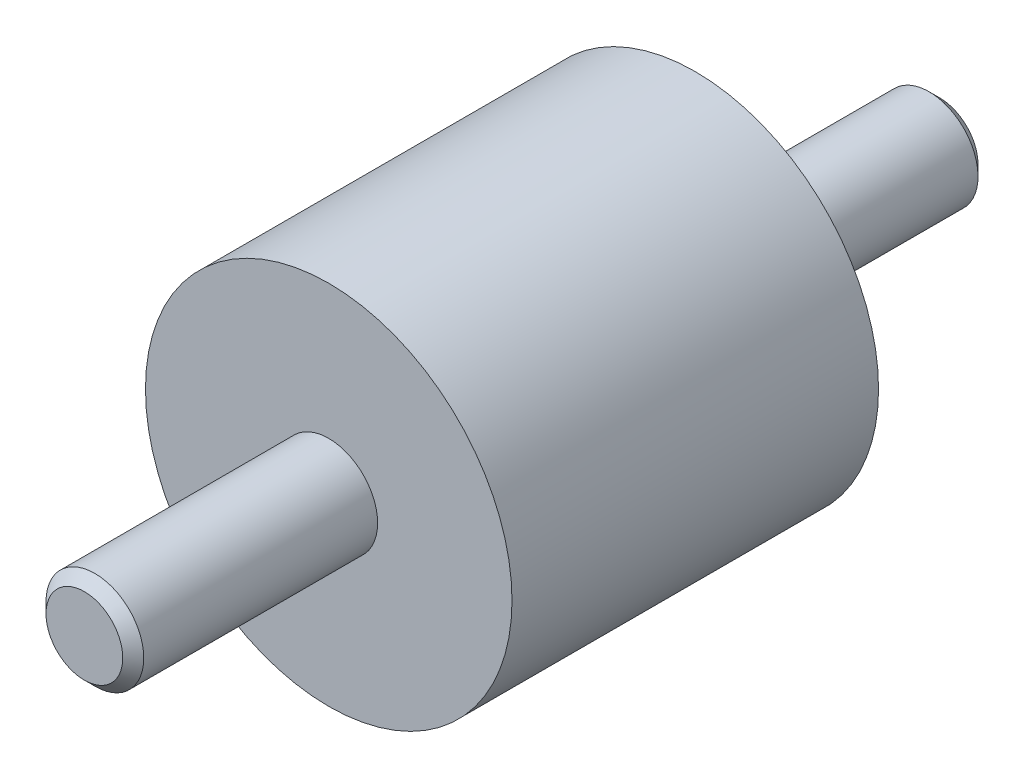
ISO-10303-21;
HEADER;
FILE_DESCRIPTION(('STEP AP214'),'2;1');
FILE_NAME('part.step','',(''),(''),'','','');
FILE_SCHEMA(('AUTOMOTIVE_DESIGN { 1 0 10303 214 1 1 1 1 }'));
ENDSEC;
DATA;
#1=APPLICATION_CONTEXT('core data for automotive mechanical design processes');
#2=APPLICATION_PROTOCOL_DEFINITION('international standard','automotive_design',2000,#1);
#3=PRODUCT_CONTEXT('',#1,'mechanical');
#4=PRODUCT('Part','Part','',(#3));
#5=PRODUCT_RELATED_PRODUCT_CATEGORY('part','',(#4));
#6=PRODUCT_DEFINITION_FORMATION('','',#4);
#7=PRODUCT_DEFINITION_CONTEXT('part definition',#1,'design');
#8=PRODUCT_DEFINITION('design','',#6,#7);
#9=PRODUCT_DEFINITION_SHAPE('','',#8);
#10=(LENGTH_UNIT() NAMED_UNIT(*) SI_UNIT(.MILLI.,.METRE.));
#11=(NAMED_UNIT(*) PLANE_ANGLE_UNIT() SI_UNIT($,.RADIAN.));
#12=(NAMED_UNIT(*) SI_UNIT($,.STERADIAN.) SOLID_ANGLE_UNIT());
#13=UNCERTAINTY_MEASURE_WITH_UNIT(LENGTH_MEASURE(1.E-05),#10,'distance_accuracy_value','');
#14=(GEOMETRIC_REPRESENTATION_CONTEXT(3) GLOBAL_UNCERTAINTY_ASSIGNED_CONTEXT((#13)) GLOBAL_UNIT_ASSIGNED_CONTEXT((#10,
#11,#12)) REPRESENTATION_CONTEXT('',''));
#15=CARTESIAN_POINT('',(0.,0.,0.));
#16=DIRECTION('',(0.,0.,1.));
#17=DIRECTION('',(1.,0.,0.));
#18=AXIS2_PLACEMENT_3D('',#15,#16,#17);
#19=CARTESIAN_POINT('',(0.,0.,0.26666666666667));
#20=DIRECTION('',(0.,0.,1.));
#21=DIRECTION('',(0.,-1.,0.));
#22=AXIS2_PLACEMENT_3D('',#19,#20,#21);
#23=CYLINDRICAL_SURFACE('',#22,7.5);
#24=CARTESIAN_POINT('',(0.,0.,0.));
#25=DIRECTION('',(0.,0.,1.));
#26=DIRECTION('',(0.,-1.,0.));
#27=AXIS2_PLACEMENT_3D('',#24,#25,#26);
#28=CIRCLE('',#27,7.5);
#29=CARTESIAN_POINT('',(0.,-7.5,0.));
#30=VERTEX_POINT('',#29);
#31=EDGE_CURVE('E22',#30,#30,#28,.T.);
#32=ORIENTED_EDGE('',*,*,#31,.T.);
#33=EDGE_LOOP('',(#32));
#34=FACE_BOUND('',#33,.T.);
#35=CARTESIAN_POINT('',(0.,0.,15.));
#36=DIRECTION('',(0.,0.,-1.));
#37=DIRECTION('',(-1.,0.,0.));
#38=AXIS2_PLACEMENT_3D('',#35,#36,#37);
#39=CIRCLE('',#38,7.5);
#40=CARTESIAN_POINT('',(-7.5,0.,15.));
#41=VERTEX_POINT('',#40);
#42=EDGE_CURVE('E34',#41,#41,#39,.T.);
#43=ORIENTED_EDGE('',*,*,#42,.T.);
#44=EDGE_LOOP('',(#43));
#45=FACE_BOUND('',#44,.T.);
#46=ADVANCED_FACE('F12',(#34,#45),#23,.T.);
#47=CARTESIAN_POINT('',(7.5,0.,0.));
#48=DIRECTION('',(0.,0.,-1.));
#49=DIRECTION('',(0.,1.,0.));
#50=AXIS2_PLACEMENT_3D('',#47,#48,#49);
#51=PLANE('',#50);
#52=CARTESIAN_POINT('',(0.,0.,0.));
#53=DIRECTION('',(0.,0.,-1.));
#54=DIRECTION('',(0.,1.,0.));
#55=AXIS2_PLACEMENT_3D('',#52,#53,#54);
#56=CIRCLE('',#55,2.);
#57=CARTESIAN_POINT('',(0.,2.,0.));
#58=VERTEX_POINT('',#57);
#59=EDGE_CURVE('E18',#58,#58,#56,.T.);
#60=ORIENTED_EDGE('',*,*,#59,.F.);
#61=EDGE_LOOP('',(#60));
#62=FACE_BOUND('',#61,.T.);
#63=ORIENTED_EDGE('',*,*,#31,.F.);
#64=EDGE_LOOP('',(#63));
#65=FACE_BOUND('',#64,.T.);
#66=ADVANCED_FACE('F61',(#62,#65),#51,.T.);
#67=CARTESIAN_POINT('',(0.,0.,-10.));
#68=DIRECTION('',(0.,0.,1.));
#69=DIRECTION('',(0.,-1.,0.));
#70=AXIS2_PLACEMENT_3D('',#67,#68,#69);
#71=CYLINDRICAL_SURFACE('',#70,2.);
#72=CARTESIAN_POINT('',(0.,0.,-9.5705));
#73=DIRECTION('',(0.,0.,1.));
#74=DIRECTION('',(0.,-1.,0.));
#75=AXIS2_PLACEMENT_3D('',#72,#73,#74);
#76=CIRCLE('',#75,2.);
#77=CARTESIAN_POINT('',(0.,-2.,-9.5705));
#78=VERTEX_POINT('',#77);
#79=EDGE_CURVE('E26',#78,#78,#76,.T.);
#80=ORIENTED_EDGE('',*,*,#79,.T.);
#81=EDGE_LOOP('',(#80));
#82=FACE_BOUND('',#81,.T.);
#83=ORIENTED_EDGE('',*,*,#59,.T.);
#84=EDGE_LOOP('',(#83));
#85=FACE_BOUND('',#84,.T.);
#86=ADVANCED_FACE('F66',(#82,#85),#71,.T.);
#87=CARTESIAN_POINT('',(0.,0.,-9.5705));
#88=DIRECTION('',(0.,0.,1.));
#89=DIRECTION('',(0.,-1.,0.));
#90=AXIS2_PLACEMENT_3D('',#87,#88,#89);
#91=CONICAL_SURFACE('',#90,2.,0.785398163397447);
#92=CARTESIAN_POINT('',(0.,0.,-10.));
#93=DIRECTION('',(0.,0.,1.));
#94=DIRECTION('',(0.,-1.,0.));
#95=AXIS2_PLACEMENT_3D('',#92,#93,#94);
#96=CIRCLE('',#95,1.5705);
#97=CARTESIAN_POINT('',(0.,-1.5705,-10.));
#98=VERTEX_POINT('',#97);
#99=EDGE_CURVE('E31',#98,#98,#96,.T.);
#100=ORIENTED_EDGE('',*,*,#99,.T.);
#101=EDGE_LOOP('',(#100));
#102=FACE_BOUND('',#101,.T.);
#103=ORIENTED_EDGE('',*,*,#79,.F.);
#104=EDGE_LOOP('',(#103));
#105=FACE_BOUND('',#104,.T.);
#106=ADVANCED_FACE('F78',(#102,#105),#91,.T.);
#107=CARTESIAN_POINT('',(1.5705,0.,-10.));
#108=DIRECTION('',(0.,0.,-1.));
#109=DIRECTION('',(0.,1.,0.));
#110=AXIS2_PLACEMENT_3D('',#107,#108,#109);
#111=PLANE('',#110);
#112=ORIENTED_EDGE('',*,*,#99,.F.);
#113=EDGE_LOOP('',(#112));
#114=FACE_BOUND('',#113,.T.);
#115=ADVANCED_FACE('F73',(#114),#111,.T.);
#116=CARTESIAN_POINT('',(0.,7.5,15.));
#117=DIRECTION('',(0.,0.,1.));
#118=DIRECTION('',(1.,0.,0.));
#119=AXIS2_PLACEMENT_3D('',#116,#117,#118);
#120=PLANE('',#119);
#121=CARTESIAN_POINT('',(0.,0.,15.));
#122=DIRECTION('',(0.,0.,1.));
#123=DIRECTION('',(1.,0.,0.));
#124=AXIS2_PLACEMENT_3D('',#121,#122,#123);
#125=CIRCLE('',#124,2.);
#126=CARTESIAN_POINT('',(2.,0.,15.));
#127=VERTEX_POINT('',#126);
#128=EDGE_CURVE('E8',#127,#127,#125,.F.);
#129=ORIENTED_EDGE('',*,*,#128,.T.);
#130=EDGE_LOOP('',(#129));
#131=FACE_BOUND('',#130,.T.);
#132=ORIENTED_EDGE('',*,*,#42,.F.);
#133=EDGE_LOOP('',(#132));
#134=FACE_BOUND('',#133,.T.);
#135=ADVANCED_FACE('F57',(#131,#134),#120,.T.);
#136=CARTESIAN_POINT('',(0.,0.,8.));
#137=DIRECTION('',(0.,0.,1.));
#138=DIRECTION('',(0.,-1.,0.));
#139=AXIS2_PLACEMENT_3D('',#136,#137,#138);
#140=CYLINDRICAL_SURFACE('',#139,2.);
#141=ORIENTED_EDGE('',*,*,#128,.F.);
#142=EDGE_LOOP('',(#141));
#143=FACE_BOUND('',#142,.T.);
#144=CARTESIAN_POINT('',(0.,0.,24.5705));
#145=DIRECTION('',(0.,0.,-1.));
#146=DIRECTION('',(-1.,0.,0.));
#147=AXIS2_PLACEMENT_3D('',#144,#145,#146);
#148=CIRCLE('',#147,2.);
#149=CARTESIAN_POINT('',(-2.,0.,24.5705));
#150=VERTEX_POINT('',#149);
#151=EDGE_CURVE('E37',#150,#150,#148,.T.);
#152=ORIENTED_EDGE('',*,*,#151,.T.);
#153=EDGE_LOOP('',(#152));
#154=FACE_BOUND('',#153,.T.);
#155=ADVANCED_FACE('F49',(#143,#154),#140,.T.);
#156=CARTESIAN_POINT('',(0.,1.5705,25.));
#157=DIRECTION('',(0.,0.,1.));
#158=DIRECTION('',(1.,0.,0.));
#159=AXIS2_PLACEMENT_3D('',#156,#157,#158);
#160=PLANE('',#159);
#161=CARTESIAN_POINT('',(0.,0.,25.));
#162=DIRECTION('',(0.,0.,-1.));
#163=DIRECTION('',(-1.,0.,0.));
#164=AXIS2_PLACEMENT_3D('',#161,#162,#163);
#165=CIRCLE('',#164,1.5705);
#166=CARTESIAN_POINT('',(-1.5705,0.,25.));
#167=VERTEX_POINT('',#166);
#168=EDGE_CURVE('E40',#167,#167,#165,.T.);
#169=ORIENTED_EDGE('',*,*,#168,.F.);
#170=EDGE_LOOP('',(#169));
#171=FACE_BOUND('',#170,.T.);
#172=ADVANCED_FACE('F47',(#171),#160,.T.);
#173=CARTESIAN_POINT('',(0.,0.,24.5705));
#174=DIRECTION('',(0.,0.,-1.));
#175=DIRECTION('',(-1.,0.,0.));
#176=AXIS2_PLACEMENT_3D('',#173,#174,#175);
#177=CONICAL_SURFACE('',#176,2.,0.785398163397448);
#178=ORIENTED_EDGE('',*,*,#168,.T.);
#179=EDGE_LOOP('',(#178));
#180=FACE_BOUND('',#179,.T.);
#181=ORIENTED_EDGE('',*,*,#151,.F.);
#182=EDGE_LOOP('',(#181));
#183=FACE_BOUND('',#182,.T.);
#184=ADVANCED_FACE('F44',(#180,#183),#177,.T.);
#185=CLOSED_SHELL('',(#46,#66,#86,#106,#115,#135,#155,#172,#184));
#186=MANIFOLD_SOLID_BREP('B1',#185);
#187=ADVANCED_BREP_SHAPE_REPRESENTATION('',(#18,#186),#14);
#188=SHAPE_DEFINITION_REPRESENTATION(#9,#187);
ENDSEC;
END-ISO-10303-21;
